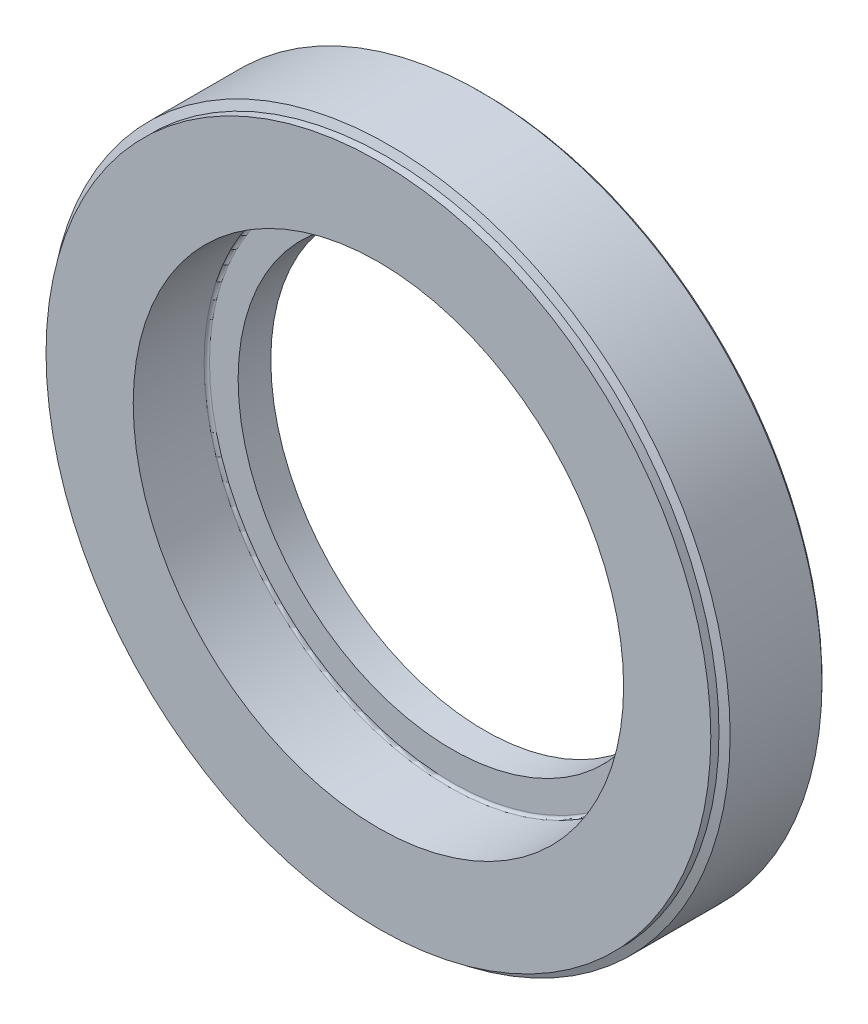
ISO-10303-21;
HEADER;
FILE_DESCRIPTION(('STEP AP214'),'2;1');
FILE_NAME('part.step','',(''),(''),'','','');
FILE_SCHEMA(('AUTOMOTIVE_DESIGN { 1 0 10303 214 1 1 1 1 }'));
ENDSEC;
DATA;
#1=APPLICATION_CONTEXT('core data for automotive mechanical design processes');
#2=APPLICATION_PROTOCOL_DEFINITION('international standard','automotive_design',2000,#1);
#3=PRODUCT_CONTEXT('',#1,'mechanical');
#4=PRODUCT('Part','Part','',(#3));
#5=PRODUCT_RELATED_PRODUCT_CATEGORY('part','',(#4));
#6=PRODUCT_DEFINITION_FORMATION('','',#4);
#7=PRODUCT_DEFINITION_CONTEXT('part definition',#1,'design');
#8=PRODUCT_DEFINITION('design','',#6,#7);
#9=PRODUCT_DEFINITION_SHAPE('','',#8);
#10=(LENGTH_UNIT() NAMED_UNIT(*) SI_UNIT(.MILLI.,.METRE.));
#11=(NAMED_UNIT(*) PLANE_ANGLE_UNIT() SI_UNIT($,.RADIAN.));
#12=(NAMED_UNIT(*) SI_UNIT($,.STERADIAN.) SOLID_ANGLE_UNIT());
#13=UNCERTAINTY_MEASURE_WITH_UNIT(LENGTH_MEASURE(1.E-05),#10,'distance_accuracy_value','');
#14=(GEOMETRIC_REPRESENTATION_CONTEXT(3) GLOBAL_UNCERTAINTY_ASSIGNED_CONTEXT((#13)) GLOBAL_UNIT_ASSIGNED_CONTEXT((#10,
#11,#12)) REPRESENTATION_CONTEXT('',''));
#15=CARTESIAN_POINT('',(0.,0.,0.));
#16=DIRECTION('',(0.,0.,1.));
#17=DIRECTION('',(1.,0.,0.));
#18=AXIS2_PLACEMENT_3D('',#15,#16,#17);
#19=CARTESIAN_POINT('',(61.9,0.,-19.5));
#20=DIRECTION('',(0.,0.,1.));
#21=DIRECTION('',(1.,0.,0.));
#22=AXIS2_PLACEMENT_3D('',#19,#20,#21);
#23=PLANE('',#22);
#24=CARTESIAN_POINT('',(0.,0.,-19.5));
#25=DIRECTION('',(0.,0.,-1.));
#26=DIRECTION('',(-1.,0.,0.));
#27=AXIS2_PLACEMENT_3D('',#24,#25,#26);
#28=CIRCLE('',#27,61.9);
#29=CARTESIAN_POINT('',(-61.9,0.,-19.5));
#30=VERTEX_POINT('',#29);
#31=EDGE_CURVE('E11',#30,#30,#28,.T.);
#32=ORIENTED_EDGE('',*,*,#31,.T.);
#33=EDGE_LOOP('',(#32));
#34=FACE_BOUND('',#33,.T.);
#35=CARTESIAN_POINT('',(0.,0.,-19.5));
#36=DIRECTION('',(0.,0.,-1.));
#37=DIRECTION('',(-1.,0.,0.));
#38=AXIS2_PLACEMENT_3D('',#35,#36,#37);
#39=CIRCLE('',#38,39.25);
#40=CARTESIAN_POINT('',(-39.25,0.,-19.5));
#41=VERTEX_POINT('',#40);
#42=EDGE_CURVE('E65',#41,#41,#39,.T.);
#43=ORIENTED_EDGE('',*,*,#42,.F.);
#44=EDGE_LOOP('',(#43));
#45=FACE_BOUND('',#44,.T.);
#46=CARTESIAN_POINT('',(0.,-55.,-19.5));
#47=DIRECTION('',(0.,0.,-1.));
#48=DIRECTION('',(-1.,0.,0.));
#49=AXIS2_PLACEMENT_3D('',#46,#47,#48);
#50=CIRCLE('',#49,2.5);
#51=CARTESIAN_POINT('',(-2.5,-55.,-19.5));
#52=VERTEX_POINT('',#51);
#53=EDGE_CURVE('E68',#52,#52,#50,.T.);
#54=ORIENTED_EDGE('',*,*,#53,.F.);
#55=EDGE_LOOP('',(#54));
#56=FACE_BOUND('',#55,.T.);
#57=ADVANCED_FACE('F31',(#34,#45,#56),#23,.F.);
#58=CARTESIAN_POINT('',(0.,0.,-18.9));
#59=DIRECTION('',(0.,0.,1.));
#60=DIRECTION('',(1.,0.,0.));
#61=AXIS2_PLACEMENT_3D('',#58,#59,#60);
#62=CONICAL_SURFACE('',#61,62.5,0.785398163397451);
#63=ORIENTED_EDGE('',*,*,#31,.F.);
#64=EDGE_LOOP('',(#63));
#65=FACE_BOUND('',#64,.T.);
#66=CARTESIAN_POINT('',(0.,0.,-18.9));
#67=DIRECTION('',(0.,0.,-1.));
#68=DIRECTION('',(-1.,0.,0.));
#69=AXIS2_PLACEMENT_3D('',#66,#67,#68);
#70=CIRCLE('',#69,62.5);
#71=CARTESIAN_POINT('',(-62.5,0.,-18.9));
#72=VERTEX_POINT('',#71);
#73=EDGE_CURVE('E37',#72,#72,#70,.T.);
#74=ORIENTED_EDGE('',*,*,#73,.T.);
#75=EDGE_LOOP('',(#74));
#76=FACE_BOUND('',#75,.T.);
#77=ADVANCED_FACE('F53',(#65,#76),#62,.T.);
#78=CARTESIAN_POINT('',(0.,0.,0.));
#79=DIRECTION('',(0.,0.,-1.));
#80=DIRECTION('',(-1.,0.,0.));
#81=AXIS2_PLACEMENT_3D('',#78,#79,#80);
#82=CYLINDRICAL_SURFACE('',#81,62.5);
#83=ORIENTED_EDGE('',*,*,#73,.F.);
#84=EDGE_LOOP('',(#83));
#85=FACE_BOUND('',#84,.T.);
#86=CARTESIAN_POINT('',(0.,0.,-2.0459553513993));
#87=DIRECTION('',(0.,0.,-1.));
#88=DIRECTION('',(-1.,0.,0.));
#89=AXIS2_PLACEMENT_3D('',#86,#87,#88);
#90=CIRCLE('',#89,62.5);
#91=CARTESIAN_POINT('',(-62.5,0.,-2.0459553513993));
#92=VERTEX_POINT('',#91);
#93=EDGE_CURVE('E92',#92,#92,#90,.T.);
#94=ORIENTED_EDGE('',*,*,#93,.T.);
#95=EDGE_LOOP('',(#94));
#96=FACE_BOUND('',#95,.T.);
#97=ADVANCED_FACE('F58',(#85,#96),#82,.T.);
#98=CARTESIAN_POINT('',(0.,0.,-1.5));
#99=DIRECTION('',(0.,0.,-1.));
#100=DIRECTION('',(-1.,0.,0.));
#101=AXIS2_PLACEMENT_3D('',#98,#99,#100);
#102=CONICAL_SURFACE('',#101,61.,1.22173047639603);
#103=ORIENTED_EDGE('',*,*,#93,.F.);
#104=EDGE_LOOP('',(#103));
#105=FACE_BOUND('',#104,.T.);
#106=CARTESIAN_POINT('',(0.,0.,-1.5));
#107=DIRECTION('',(0.,0.,-1.));
#108=DIRECTION('',(-1.,0.,0.));
#109=AXIS2_PLACEMENT_3D('',#106,#107,#108);
#110=CIRCLE('',#109,61.);
#111=CARTESIAN_POINT('',(-61.,0.,-1.5));
#112=VERTEX_POINT('',#111);
#113=EDGE_CURVE('E89',#112,#112,#110,.T.);
#114=ORIENTED_EDGE('',*,*,#113,.T.);
#115=EDGE_LOOP('',(#114));
#116=FACE_BOUND('',#115,.T.);
#117=ADVANCED_FACE('F100',(#105,#116),#102,.T.);
#118=CARTESIAN_POINT('',(0.,0.,0.));
#119=DIRECTION('',(0.,0.,-1.));
#120=DIRECTION('',(-1.,0.,0.));
#121=AXIS2_PLACEMENT_3D('',#118,#119,#120);
#122=CYLINDRICAL_SURFACE('',#121,61.);
#123=ORIENTED_EDGE('',*,*,#113,.F.);
#124=EDGE_LOOP('',(#123));
#125=FACE_BOUND('',#124,.T.);
#126=CARTESIAN_POINT('',(0.,0.,0.));
#127=DIRECTION('',(0.,0.,-1.));
#128=DIRECTION('',(-1.,0.,0.));
#129=AXIS2_PLACEMENT_3D('',#126,#127,#128);
#130=CIRCLE('',#129,61.);
#131=CARTESIAN_POINT('',(-61.,0.,0.));
#132=VERTEX_POINT('',#131);
#133=EDGE_CURVE('E86',#132,#132,#130,.T.);
#134=ORIENTED_EDGE('',*,*,#133,.T.);
#135=EDGE_LOOP('',(#134));
#136=FACE_BOUND('',#135,.T.);
#137=ADVANCED_FACE('F106',(#125,#136),#122,.T.);
#138=CARTESIAN_POINT('',(45.,0.,0.));
#139=DIRECTION('',(0.,0.,-1.));
#140=DIRECTION('',(-1.,0.,0.));
#141=AXIS2_PLACEMENT_3D('',#138,#139,#140);
#142=PLANE('',#141);
#143=ORIENTED_EDGE('',*,*,#133,.F.);
#144=EDGE_LOOP('',(#143));
#145=FACE_BOUND('',#144,.T.);
#146=CARTESIAN_POINT('',(0.,0.,0.));
#147=DIRECTION('',(0.,0.,-1.));
#148=DIRECTION('',(-1.,0.,0.));
#149=AXIS2_PLACEMENT_3D('',#146,#147,#148);
#150=CIRCLE('',#149,45.);
#151=CARTESIAN_POINT('',(-45.,0.,0.));
#152=VERTEX_POINT('',#151);
#153=EDGE_CURVE('E83',#152,#152,#150,.T.);
#154=ORIENTED_EDGE('',*,*,#153,.T.);
#155=EDGE_LOOP('',(#154));
#156=FACE_BOUND('',#155,.T.);
#157=ADVANCED_FACE('F112',(#145,#156),#142,.F.);
#158=CARTESIAN_POINT('',(0.,0.,0.));
#159=DIRECTION('',(0.,0.,-1.));
#160=DIRECTION('',(-1.,0.,0.));
#161=AXIS2_PLACEMENT_3D('',#158,#159,#160);
#162=CYLINDRICAL_SURFACE('',#161,45.);
#163=ORIENTED_EDGE('',*,*,#153,.F.);
#164=EDGE_LOOP('',(#163));
#165=FACE_BOUND('',#164,.T.);
#166=CARTESIAN_POINT('',(0.,0.,-12.9999999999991));
#167=DIRECTION('',(0.,0.,-1.));
#168=DIRECTION('',(-1.,0.,0.));
#169=AXIS2_PLACEMENT_3D('',#166,#167,#168);
#170=CIRCLE('',#169,45.);
#171=CARTESIAN_POINT('',(-45.,0.,-12.9999999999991));
#172=VERTEX_POINT('',#171);
#173=EDGE_CURVE('E80',#172,#172,#170,.T.);
#174=ORIENTED_EDGE('',*,*,#173,.T.);
#175=EDGE_LOOP('',(#174));
#176=FACE_BOUND('',#175,.T.);
#177=ADVANCED_FACE('F118',(#165,#176),#162,.F.);
#178=CARTESIAN_POINT('',(0.,0.,-12.9999999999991));
#179=DIRECTION('',(0.,0.,-1.));
#180=DIRECTION('',(-1.,0.,0.));
#181=AXIS2_PLACEMENT_3D('',#178,#179,#180);
#182=TOROIDAL_SURFACE('',#181,44.4999999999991,0.500000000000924);
#183=ORIENTED_EDGE('',*,*,#173,.F.);
#184=EDGE_LOOP('',(#183));
#185=FACE_BOUND('',#184,.T.);
#186=CARTESIAN_POINT('',(0.,0.,-13.5));
#187=DIRECTION('',(0.,0.,-1.));
#188=DIRECTION('',(-1.,0.,0.));
#189=AXIS2_PLACEMENT_3D('',#186,#187,#188);
#190=CIRCLE('',#189,44.4999999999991);
#191=CARTESIAN_POINT('',(-44.4999999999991,0.,-13.5));
#192=VERTEX_POINT('',#191);
#193=EDGE_CURVE('E77',#192,#192,#190,.T.);
#194=ORIENTED_EDGE('',*,*,#193,.T.);
#195=EDGE_LOOP('',(#194));
#196=FACE_BOUND('',#195,.T.);
#197=ADVANCED_FACE('F124',(#185,#196),#182,.F.);
#198=CARTESIAN_POINT('',(39.25,0.,-13.5));
#199=DIRECTION('',(0.,0.,-1.));
#200=DIRECTION('',(-1.,0.,0.));
#201=AXIS2_PLACEMENT_3D('',#198,#199,#200);
#202=PLANE('',#201);
#203=ORIENTED_EDGE('',*,*,#193,.F.);
#204=EDGE_LOOP('',(#203));
#205=FACE_BOUND('',#204,.T.);
#206=CARTESIAN_POINT('',(0.,0.,-13.5));
#207=DIRECTION('',(0.,0.,-1.));
#208=DIRECTION('',(-1.,0.,0.));
#209=AXIS2_PLACEMENT_3D('',#206,#207,#208);
#210=CIRCLE('',#209,39.25);
#211=CARTESIAN_POINT('',(-39.25,0.,-13.5));
#212=VERTEX_POINT('',#211);
#213=EDGE_CURVE('E71',#212,#212,#210,.T.);
#214=ORIENTED_EDGE('',*,*,#213,.T.);
#215=EDGE_LOOP('',(#214));
#216=FACE_BOUND('',#215,.T.);
#217=ADVANCED_FACE('F130',(#205,#216),#202,.F.);
#218=CARTESIAN_POINT('',(0.,0.,0.));
#219=DIRECTION('',(0.,0.,-1.));
#220=DIRECTION('',(-1.,0.,0.));
#221=AXIS2_PLACEMENT_3D('',#218,#219,#220);
#222=CYLINDRICAL_SURFACE('',#221,39.25);
#223=ORIENTED_EDGE('',*,*,#213,.F.);
#224=EDGE_LOOP('',(#223));
#225=FACE_BOUND('',#224,.T.);
#226=ORIENTED_EDGE('',*,*,#42,.T.);
#227=EDGE_LOOP('',(#226));
#228=FACE_BOUND('',#227,.T.);
#229=ADVANCED_FACE('F48',(#225,#228),#222,.F.);
#230=CARTESIAN_POINT('',(0.,-55.,-14.056624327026));
#231=DIRECTION('',(0.,0.,-1.));
#232=DIRECTION('',(-1.,0.,0.));
#233=AXIS2_PLACEMENT_3D('',#230,#231,#232);
#234=CYLINDRICAL_SURFACE('',#233,2.5);
#235=ORIENTED_EDGE('',*,*,#53,.T.);
#236=EDGE_LOOP('',(#235));
#237=FACE_BOUND('',#236,.T.);
#238=CARTESIAN_POINT('',(0.,-55.,-15.5));
#239=DIRECTION('',(0.,0.,-1.));
#240=DIRECTION('',(-1.,0.,0.));
#241=AXIS2_PLACEMENT_3D('',#238,#239,#240);
#242=CIRCLE('',#241,2.5);
#243=CARTESIAN_POINT('',(-2.5,-55.,-15.5));
#244=VERTEX_POINT('',#243);
#245=EDGE_CURVE('E69',#244,#244,#242,.T.);
#246=ORIENTED_EDGE('',*,*,#245,.F.);
#247=EDGE_LOOP('',(#246));
#248=FACE_BOUND('',#247,.T.);
#249=ADVANCED_FACE('F42',(#237,#248),#234,.F.);
#250=CARTESIAN_POINT('',(0.,-55.,-14.056624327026));
#251=DIRECTION('',(0.,0.,-1.));
#252=DIRECTION('',(-1.,0.,0.));
#253=AXIS2_PLACEMENT_3D('',#250,#251,#252);
#254=CONICAL_SURFACE('',#253,0.,1.04719755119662);
#255=ORIENTED_EDGE('',*,*,#245,.T.);
#256=EDGE_LOOP('',(#255));
#257=FACE_BOUND('',#256,.T.);
#258=CARTESIAN_POINT('',(0.,-55.,-14.056624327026));
#259=VERTEX_POINT('',#258);
#260=VERTEX_LOOP('',#259);
#261=FACE_BOUND('',#260,.T.);
#262=ADVANCED_FACE('F40',(#257,#261),#254,.F.);
#263=CLOSED_SHELL('',(#57,#77,#97,#117,#137,#157,#177,#197,#217,#229,#249,#262));
#264=MANIFOLD_SOLID_BREP('B2',#263);
#265=ADVANCED_BREP_SHAPE_REPRESENTATION('',(#18,#264),#14);
#266=SHAPE_DEFINITION_REPRESENTATION(#9,#265);
ENDSEC;
END-ISO-10303-21;
